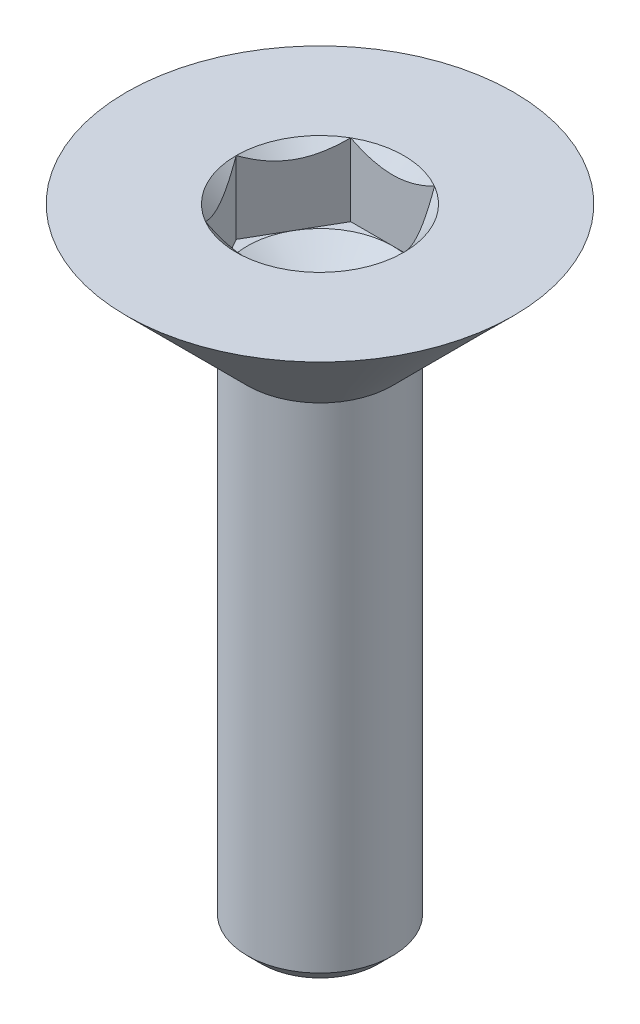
ISO-10303-21;
HEADER;
FILE_DESCRIPTION(('STEP AP214'),'2;1');
FILE_NAME('part.step','',(''),(''),'','','');
FILE_SCHEMA(('AUTOMOTIVE_DESIGN { 1 0 10303 214 1 1 1 1 }'));
ENDSEC;
DATA;
#1=APPLICATION_CONTEXT('core data for automotive mechanical design processes');
#2=APPLICATION_PROTOCOL_DEFINITION('international standard','automotive_design',2000,#1);
#3=PRODUCT_CONTEXT('',#1,'mechanical');
#4=PRODUCT('Part','Part','',(#3));
#5=PRODUCT_RELATED_PRODUCT_CATEGORY('part','',(#4));
#6=PRODUCT_DEFINITION_FORMATION('','',#4);
#7=PRODUCT_DEFINITION_CONTEXT('part definition',#1,'design');
#8=PRODUCT_DEFINITION('design','',#6,#7);
#9=PRODUCT_DEFINITION_SHAPE('','',#8);
#10=(LENGTH_UNIT() NAMED_UNIT(*) SI_UNIT(.MILLI.,.METRE.));
#11=(NAMED_UNIT(*) PLANE_ANGLE_UNIT() SI_UNIT($,.RADIAN.));
#12=(NAMED_UNIT(*) SI_UNIT($,.STERADIAN.) SOLID_ANGLE_UNIT());
#13=UNCERTAINTY_MEASURE_WITH_UNIT(LENGTH_MEASURE(1.E-05),#10,'distance_accuracy_value','');
#14=(GEOMETRIC_REPRESENTATION_CONTEXT(3) GLOBAL_UNCERTAINTY_ASSIGNED_CONTEXT((#13)) GLOBAL_UNIT_ASSIGNED_CONTEXT((#10,
#11,#12)) REPRESENTATION_CONTEXT('',''));
#15=CARTESIAN_POINT('',(0.,0.,0.));
#16=DIRECTION('',(0.,0.,1.));
#17=DIRECTION('',(1.,0.,0.));
#18=AXIS2_PLACEMENT_3D('',#15,#16,#17);
#19=CARTESIAN_POINT('',(3.46410161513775,2.,0.));
#20=DIRECTION('',(0.,1.,0.));
#21=DIRECTION('',(0.,0.,1.));
#22=AXIS2_PLACEMENT_3D('',#19,#20,#21);
#23=PLANE('',#22);
#24=CARTESIAN_POINT('',(0.,2.,0.));
#25=DIRECTION('',(0.,1.,0.));
#26=DIRECTION('',(0.,0.,1.));
#27=AXIS2_PLACEMENT_3D('',#24,#25,#26);
#28=CIRCLE('',#27,3.);
#29=CARTESIAN_POINT('',(0.,2.,3.));
#30=VERTEX_POINT('',#29);
#31=CARTESIAN_POINT('',(2.59807621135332,2.,1.5));
#32=VERTEX_POINT('',#31);
#33=EDGE_CURVE('E96',#30,#32,#28,.T.);
#34=ORIENTED_EDGE('',*,*,#33,.F.);
#35=DIRECTION('',(1.,0.,0.));
#36=VECTOR('',#35,1.);
#37=CARTESIAN_POINT('',(-1.73205080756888,2.,3.));
#38=LINE('',#37,#36);
#39=CARTESIAN_POINT('',(1.73205080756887,2.,3.));
#40=VERTEX_POINT('',#39);
#41=EDGE_CURVE('E40',#30,#40,#38,.T.);
#42=ORIENTED_EDGE('',*,*,#41,.T.);
#43=DIRECTION('',(0.5,0.,-0.866025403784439));
#44=VECTOR('',#43,1.);
#45=CARTESIAN_POINT('',(1.73205080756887,2.,3.));
#46=LINE('',#45,#44);
#47=EDGE_CURVE('E117',#40,#32,#46,.T.);
#48=ORIENTED_EDGE('',*,*,#47,.T.);
#49=EDGE_LOOP('',(#34,#42,#48));
#50=FACE_BOUND('',#49,.T.);
#51=ADVANCED_FACE('F17',(#50),#23,.T.);
#52=CARTESIAN_POINT('',(0.,2.,0.));
#53=DIRECTION('',(0.,1.,0.));
#54=DIRECTION('',(0.,0.,1.));
#55=AXIS2_PLACEMENT_3D('',#52,#53,#54);
#56=CIRCLE('',#55,3.);
#57=CARTESIAN_POINT('',(2.59807621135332,2.,-1.5));
#58=VERTEX_POINT('',#57);
#59=EDGE_CURVE('E98',#32,#58,#56,.T.);
#60=ORIENTED_EDGE('',*,*,#59,.F.);
#61=CARTESIAN_POINT('',(3.46410161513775,2.,0.));
#62=VERTEX_POINT('',#61);
#63=EDGE_CURVE('E107',#32,#62,#46,.T.);
#64=ORIENTED_EDGE('',*,*,#63,.T.);
#65=DIRECTION('',(-0.5,0.,-0.866025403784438));
#66=VECTOR('',#65,1.);
#67=CARTESIAN_POINT('',(3.46410161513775,2.,0.));
#68=LINE('',#67,#66);
#69=EDGE_CURVE('E110',#62,#58,#68,.T.);
#70=ORIENTED_EDGE('',*,*,#69,.T.);
#71=EDGE_LOOP('',(#60,#64,#70));
#72=FACE_BOUND('',#71,.T.);
#73=ADVANCED_FACE('F106',(#72),#23,.T.);
#74=CARTESIAN_POINT('',(0.,2.,-3.));
#75=VERTEX_POINT('',#74);
#76=EDGE_CURVE('E111',#58,#75,#56,.T.);
#77=ORIENTED_EDGE('',*,*,#76,.F.);
#78=CARTESIAN_POINT('',(1.73205080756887,2.,-3.));
#79=VERTEX_POINT('',#78);
#80=EDGE_CURVE('E123',#58,#79,#68,.T.);
#81=ORIENTED_EDGE('',*,*,#80,.T.);
#82=DIRECTION('',(-1.,0.,0.));
#83=VECTOR('',#82,1.);
#84=CARTESIAN_POINT('',(1.73205080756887,2.,-3.));
#85=LINE('',#84,#83);
#86=EDGE_CURVE('E129',#79,#75,#85,.T.);
#87=ORIENTED_EDGE('',*,*,#86,.T.);
#88=EDGE_LOOP('',(#77,#81,#87));
#89=FACE_BOUND('',#88,.T.);
#90=ADVANCED_FACE('F182',(#89),#23,.T.);
#91=CARTESIAN_POINT('',(-2.59807621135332,2.,-1.5));
#92=VERTEX_POINT('',#91);
#93=EDGE_CURVE('E212',#75,#92,#56,.T.);
#94=ORIENTED_EDGE('',*,*,#93,.F.);
#95=CARTESIAN_POINT('',(-1.73205080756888,2.,-3.));
#96=VERTEX_POINT('',#95);
#97=EDGE_CURVE('E128',#75,#96,#85,.T.);
#98=ORIENTED_EDGE('',*,*,#97,.T.);
#99=DIRECTION('',(-0.5,0.,0.866025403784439));
#100=VECTOR('',#99,1.);
#101=CARTESIAN_POINT('',(-1.73205080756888,2.,-3.));
#102=LINE('',#101,#100);
#103=EDGE_CURVE('E133',#96,#92,#102,.T.);
#104=ORIENTED_EDGE('',*,*,#103,.T.);
#105=EDGE_LOOP('',(#94,#98,#104));
#106=FACE_BOUND('',#105,.T.);
#107=ADVANCED_FACE('F200',(#106),#23,.T.);
#108=CARTESIAN_POINT('',(-2.59807621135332,2.,1.5));
#109=VERTEX_POINT('',#108);
#110=EDGE_CURVE('E32',#92,#109,#56,.T.);
#111=ORIENTED_EDGE('',*,*,#110,.F.);
#112=CARTESIAN_POINT('',(-3.46410161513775,2.,0.));
#113=VERTEX_POINT('',#112);
#114=EDGE_CURVE('E132',#92,#113,#102,.T.);
#115=ORIENTED_EDGE('',*,*,#114,.T.);
#116=DIRECTION('',(0.5,0.,0.866025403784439));
#117=VECTOR('',#116,1.);
#118=CARTESIAN_POINT('',(-3.46410161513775,2.,0.));
#119=LINE('',#118,#117);
#120=EDGE_CURVE('E137',#113,#109,#119,.T.);
#121=ORIENTED_EDGE('',*,*,#120,.T.);
#122=EDGE_LOOP('',(#111,#115,#121));
#123=FACE_BOUND('',#122,.T.);
#124=ADVANCED_FACE('F189',(#123),#23,.T.);
#125=CARTESIAN_POINT('',(0.,0.,0.));
#126=DIRECTION('',(0.,1.,0.));
#127=DIRECTION('',(0.,0.,1.));
#128=AXIS2_PLACEMENT_3D('',#125,#126,#127);
#129=CONICAL_SURFACE('',#128,3.,0.78539816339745);
#130=CARTESIAN_POINT('',(0.,5.,0.));
#131=DIRECTION('',(0.,1.,0.));
#132=DIRECTION('',(0.,0.,1.));
#133=AXIS2_PLACEMENT_3D('',#130,#131,#132);
#134=CIRCLE('',#133,8.);
#135=CARTESIAN_POINT('',(0.,5.,8.));
#136=VERTEX_POINT('',#135);
#137=EDGE_CURVE('E161',#136,#136,#134,.T.);
#138=ORIENTED_EDGE('',*,*,#137,.F.);
#139=EDGE_LOOP('',(#138));
#140=FACE_BOUND('',#139,.T.);
#141=CARTESIAN_POINT('',(0.,0.,0.));
#142=DIRECTION('',(0.,1.,0.));
#143=DIRECTION('',(0.,0.,1.));
#144=AXIS2_PLACEMENT_3D('',#141,#142,#143);
#145=CIRCLE('',#144,3.);
#146=CARTESIAN_POINT('',(0.,0.,3.));
#147=VERTEX_POINT('',#146);
#148=EDGE_CURVE('E145',#147,#147,#145,.T.);
#149=ORIENTED_EDGE('',*,*,#148,.T.);
#150=EDGE_LOOP('',(#149));
#151=FACE_BOUND('',#150,.T.);
#152=ADVANCED_FACE('F19',(#140,#151),#129,.T.);
#153=CARTESIAN_POINT('',(0.,5.,0.));
#154=DIRECTION('',(0.,1.,0.));
#155=DIRECTION('',(0.,0.,1.));
#156=AXIS2_PLACEMENT_3D('',#153,#154,#155);
#157=PLANE('',#156);
#158=CARTESIAN_POINT('',(0.,5.,0.));
#159=DIRECTION('',(0.,1.,0.));
#160=DIRECTION('',(0.,0.,1.));
#161=AXIS2_PLACEMENT_3D('',#158,#159,#160);
#162=CIRCLE('',#161,3.46410161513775);
#163=CARTESIAN_POINT('',(1.73205080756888,5.,3.));
#164=VERTEX_POINT('',#163);
#165=CARTESIAN_POINT('',(3.46410161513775,5.,0.));
#166=VERTEX_POINT('',#165);
#167=EDGE_CURVE('E101',#164,#166,#162,.T.);
#168=ORIENTED_EDGE('',*,*,#167,.F.);
#169=CARTESIAN_POINT('',(0.,5.,0.));
#170=DIRECTION('',(0.,1.,0.));
#171=DIRECTION('',(0.,0.,1.));
#172=AXIS2_PLACEMENT_3D('',#169,#170,#171);
#173=CIRCLE('',#172,3.46410161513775);
#174=CARTESIAN_POINT('',(-1.73205080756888,5.,3.));
#175=VERTEX_POINT('',#174);
#176=EDGE_CURVE('E121',#175,#164,#173,.T.);
#177=ORIENTED_EDGE('',*,*,#176,.F.);
#178=CARTESIAN_POINT('',(0.,5.,0.));
#179=DIRECTION('',(0.,1.,0.));
#180=DIRECTION('',(0.,0.,1.));
#181=AXIS2_PLACEMENT_3D('',#178,#179,#180);
#182=CIRCLE('',#181,3.46410161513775);
#183=CARTESIAN_POINT('',(-3.46410161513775,5.,0.));
#184=VERTEX_POINT('',#183);
#185=EDGE_CURVE('E237',#184,#175,#182,.T.);
#186=ORIENTED_EDGE('',*,*,#185,.F.);
#187=CARTESIAN_POINT('',(0.,5.,0.));
#188=DIRECTION('',(0.,1.,0.));
#189=DIRECTION('',(0.,0.,1.));
#190=AXIS2_PLACEMENT_3D('',#187,#188,#189);
#191=CIRCLE('',#190,3.46410161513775);
#192=CARTESIAN_POINT('',(-1.73205080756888,5.,-3.));
#193=VERTEX_POINT('',#192);
#194=EDGE_CURVE('E230',#193,#184,#191,.T.);
#195=ORIENTED_EDGE('',*,*,#194,.F.);
#196=CARTESIAN_POINT('',(0.,5.,0.));
#197=DIRECTION('',(0.,1.,0.));
#198=DIRECTION('',(0.,0.,1.));
#199=AXIS2_PLACEMENT_3D('',#196,#197,#198);
#200=CIRCLE('',#199,3.46410161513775);
#201=CARTESIAN_POINT('',(1.73205080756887,5.,-3.));
#202=VERTEX_POINT('',#201);
#203=EDGE_CURVE('E231',#202,#193,#200,.T.);
#204=ORIENTED_EDGE('',*,*,#203,.F.);
#205=CARTESIAN_POINT('',(0.,5.,0.));
#206=DIRECTION('',(0.,1.,0.));
#207=DIRECTION('',(0.,0.,1.));
#208=AXIS2_PLACEMENT_3D('',#205,#206,#207);
#209=CIRCLE('',#208,3.46410161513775);
#210=EDGE_CURVE('E265',#166,#202,#209,.T.);
#211=ORIENTED_EDGE('',*,*,#210,.F.);
#212=EDGE_LOOP('',(#168,#177,#186,#195,#204,#211));
#213=FACE_BOUND('',#212,.T.);
#214=ORIENTED_EDGE('',*,*,#137,.T.);
#215=EDGE_LOOP('',(#214));
#216=FACE_BOUND('',#215,.T.);
#217=ADVANCED_FACE('F205',(#213,#216),#157,.T.);
#218=CARTESIAN_POINT('',(0.,-21.,0.));
#219=DIRECTION('',(0.,1.,0.));
#220=DIRECTION('',(0.,0.,1.));
#221=AXIS2_PLACEMENT_3D('',#218,#219,#220);
#222=CYLINDRICAL_SURFACE('',#221,3.);
#223=CARTESIAN_POINT('',(0.,-20.4,0.));
#224=DIRECTION('',(0.,1.,0.));
#225=DIRECTION('',(0.,0.,1.));
#226=AXIS2_PLACEMENT_3D('',#223,#224,#225);
#227=CIRCLE('',#226,3.);
#228=CARTESIAN_POINT('',(0.,-20.4,3.));
#229=VERTEX_POINT('',#228);
#230=EDGE_CURVE('E25',#229,#229,#227,.T.);
#231=ORIENTED_EDGE('',*,*,#230,.T.);
#232=EDGE_LOOP('',(#231));
#233=FACE_BOUND('',#232,.T.);
#234=ORIENTED_EDGE('',*,*,#148,.F.);
#235=EDGE_LOOP('',(#234));
#236=FACE_BOUND('',#235,.T.);
#237=ADVANCED_FACE('F166',(#233,#236),#222,.T.);
#238=CARTESIAN_POINT('',(0.,-21.,0.));
#239=DIRECTION('',(0.,1.,0.));
#240=DIRECTION('',(0.,0.,1.));
#241=AXIS2_PLACEMENT_3D('',#238,#239,#240);
#242=PLANE('',#241);
#243=CARTESIAN_POINT('',(0.,-21.,0.));
#244=DIRECTION('',(0.,1.,0.));
#245=DIRECTION('',(0.,0.,1.));
#246=AXIS2_PLACEMENT_3D('',#243,#244,#245);
#247=CIRCLE('',#246,2.4);
#248=CARTESIAN_POINT('',(0.,-21.,2.4));
#249=VERTEX_POINT('',#248);
#250=EDGE_CURVE('E11',#249,#249,#247,.F.);
#251=ORIENTED_EDGE('',*,*,#250,.T.);
#252=EDGE_LOOP('',(#251));
#253=FACE_BOUND('',#252,.T.);
#254=ADVANCED_FACE('F341',(#253),#242,.F.);
#255=CARTESIAN_POINT('',(1.73205080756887,2.,3.));
#256=DIRECTION('',(0.866025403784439,0.,0.5));
#257=DIRECTION('',(0.5,0.,-0.866025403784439));
#258=AXIS2_PLACEMENT_3D('',#255,#256,#257);
#259=PLANE('',#258);
#260=DIRECTION('',(0.,1.,0.));
#261=VECTOR('',#260,1.);
#262=CARTESIAN_POINT('',(1.73205080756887,2.,3.));
#263=LINE('',#262,#261);
#264=EDGE_CURVE('E143',#40,#164,#263,.T.);
#265=ORIENTED_EDGE('',*,*,#264,.T.);
#266=CARTESIAN_POINT('',(3.4642170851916,5.00011547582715,-0.000200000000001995));
#267=CARTESIAN_POINT('',(3.40467869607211,4.94062831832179,0.102923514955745));
#268=CARTESIAN_POINT('',(3.3441447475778,4.88463497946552,0.207771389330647));
#269=CARTESIAN_POINT('',(3.22070940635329,4.78211259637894,0.421567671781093));
#270=CARTESIAN_POINT('',(3.15779627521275,4.73564059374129,0.530536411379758));
#271=CARTESIAN_POINT('',(3.03093496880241,4.6560331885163,0.750266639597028));
#272=CARTESIAN_POINT('',(2.96701910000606,4.62269770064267,0.860972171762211));
#273=CARTESIAN_POINT('',(2.83778025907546,4.5713375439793,1.08482041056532));
#274=CARTESIAN_POINT('',(2.77246123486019,4.5532745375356,1.19795627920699));
#275=CARTESIAN_POINT('',(2.65988677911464,4.53697690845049,1.3929409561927));
#276=CARTESIAN_POINT('',(2.6127767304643,4.5345643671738,1.47453795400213));
#277=CARTESIAN_POINT('',(2.51863325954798,4.53862943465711,1.63759922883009));
#278=CARTESIAN_POINT('',(2.47159986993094,4.5451101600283,1.71906344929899));
#279=CARTESIAN_POINT('',(2.37797867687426,4.56659172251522,1.88122011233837));
#280=CARTESIAN_POINT('',(2.33139143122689,4.58160208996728,1.9619115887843));
#281=CARTESIAN_POINT('',(2.23901705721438,4.61932364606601,2.12190869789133));
#282=CARTESIAN_POINT('',(2.19322986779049,4.64203424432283,2.2012144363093));
#283=CARTESIAN_POINT('',(2.11194373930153,4.68876068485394,2.34200614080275));
#284=CARTESIAN_POINT('',(2.07626488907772,4.7115483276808,2.40380372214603));
#285=CARTESIAN_POINT('',(2.00554773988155,4.76079628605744,2.52628941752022));
#286=CARTESIAN_POINT('',(1.97050946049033,4.78725671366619,2.5869774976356));
#287=CARTESIAN_POINT('',(1.90118383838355,4.84325699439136,2.70705299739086));
#288=CARTESIAN_POINT('',(1.86689452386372,4.87278716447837,2.76644383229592));
#289=CARTESIAN_POINT('',(1.79895094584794,4.93453909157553,2.88412556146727));
#290=CARTESIAN_POINT('',(1.76529630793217,4.96675919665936,2.94241710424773));
#291=CARTESIAN_POINT('',(1.73193533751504,5.00011547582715,3.0002));
#292=B_SPLINE_CURVE_WITH_KNOTS('',3,(#266,#267,#268,#269,#270,#271,#272,#273,#274,#275,#276,
#277,#278,#279,#280,#281,#282,#283,#284,#285,#286,#287,#288,#289,#290,#291),.UNSPECIFIED.,.F.,
.F.,(4,2,2,2,2,2,2,2,2,2,2,2,4),(0.,0.399603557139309,0.80153528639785,1.19708369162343,
1.59163620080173,1.87398941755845,2.15644160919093,2.43921001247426,2.72195674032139,
2.94657516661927,3.17120044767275,3.3951375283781,3.61893808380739),.UNSPECIFIED.);
#293=EDGE_CURVE('E256',#166,#164,#292,.T.);
#294=ORIENTED_EDGE('',*,*,#293,.F.);
#295=DIRECTION('',(0.,1.,0.));
#296=VECTOR('',#295,1.);
#297=CARTESIAN_POINT('',(3.46410161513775,2.,0.));
#298=LINE('',#297,#296);
#299=EDGE_CURVE('E120',#62,#166,#298,.T.);
#300=ORIENTED_EDGE('',*,*,#299,.F.);
#301=ORIENTED_EDGE('',*,*,#63,.F.);
#302=ORIENTED_EDGE('',*,*,#47,.F.);
#303=EDGE_LOOP('',(#265,#294,#300,#301,#302));
#304=FACE_BOUND('',#303,.T.);
#305=ADVANCED_FACE('F116',(#304),#259,.F.);
#306=CARTESIAN_POINT('',(-1.73205080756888,2.,3.));
#307=DIRECTION('',(0.,0.,1.));
#308=DIRECTION('',(1.,0.,0.));
#309=AXIS2_PLACEMENT_3D('',#306,#307,#308);
#310=PLANE('',#309);
#311=DIRECTION('',(0.,1.,0.));
#312=VECTOR('',#311,1.);
#313=CARTESIAN_POINT('',(-1.73205080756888,2.,3.));
#314=LINE('',#313,#312);
#315=CARTESIAN_POINT('',(-1.73205080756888,2.,3.));
#316=VERTEX_POINT('',#315);
#317=EDGE_CURVE('E146',#316,#175,#314,.T.);
#318=ORIENTED_EDGE('',*,*,#317,.T.);
#319=CARTESIAN_POINT('',(-3.50026189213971,6.14586945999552,3.));
#320=CARTESIAN_POINT('',(-3.41523785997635,6.08132698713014,3.));
#321=CARTESIAN_POINT('',(-3.32974294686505,6.01739482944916,3.));
#322=CARTESIAN_POINT('',(-3.1576236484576,5.89102603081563,3.));
#323=CARTESIAN_POINT('',(-3.07099898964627,5.82858976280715,3.));
#324=CARTESIAN_POINT('',(-2.89579876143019,5.70504340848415,3.));
#325=CARTESIAN_POINT('',(-2.80721328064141,5.64394733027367,3.));
#326=CARTESIAN_POINT('',(-2.62854680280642,5.52398973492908,3.));
#327=CARTESIAN_POINT('',(-2.53846591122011,5.4651280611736,3.));
#328=CARTESIAN_POINT('',(-2.35119236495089,5.34674237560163,3.));
#329=CARTESIAN_POINT('',(-2.25389399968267,5.28738473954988,3.));
#330=CARTESIAN_POINT('',(-2.05704987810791,5.17252661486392,3.));
#331=CARTESIAN_POINT('',(-1.95750441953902,5.11702561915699,3.));
#332=CARTESIAN_POINT('',(-1.7561226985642,5.01104681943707,3.));
#333=CARTESIAN_POINT('',(-1.654293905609,4.96055493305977,3.));
#334=CARTESIAN_POINT('',(-1.4478291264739,4.8657342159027,3.));
#335=CARTESIAN_POINT('',(-1.34319445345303,4.82140256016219,3.));
#336=CARTESIAN_POINT('',(-1.14005723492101,4.7439653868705,3.));
#337=CARTESIAN_POINT('',(-1.04180014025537,4.71022262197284,3.));
#338=CARTESIAN_POINT('',(-0.842880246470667,4.65061383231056,3.));
#339=CARTESIAN_POINT('',(-0.742217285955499,4.62474833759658,3.));
#340=CARTESIAN_POINT('',(-0.540783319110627,4.58268913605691,3.));
#341=CARTESIAN_POINT('',(-0.440048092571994,4.56632688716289,3.));
#342=CARTESIAN_POINT('',(-0.23745012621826,4.54359904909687,3.));
#343=CARTESIAN_POINT('',(-0.135587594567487,4.53723164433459,3.));
#344=CARTESIAN_POINT('',(0.0643530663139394,4.53498673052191,3.));
#345=CARTESIAN_POINT('',(0.162426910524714,4.53871728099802,3.));
#346=CARTESIAN_POINT('',(0.357756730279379,4.5555865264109,3.));
#347=CARTESIAN_POINT('',(0.455012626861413,4.56872611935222,3.));
#348=CARTESIAN_POINT('',(0.64964782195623,4.60391252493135,3.));
#349=CARTESIAN_POINT('',(0.746998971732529,4.62611253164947,3.));
#350=CARTESIAN_POINT('',(0.939574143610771,4.67822215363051,3.));
#351=CARTESIAN_POINT('',(1.03479832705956,4.70813118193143,3.));
#352=CARTESIAN_POINT('',(1.23072205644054,4.77713022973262,3.));
#353=CARTESIAN_POINT('',(1.33122436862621,4.81677445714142,3.));
#354=CARTESIAN_POINT('',(1.52961364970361,4.9021565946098,3.));
#355=CARTESIAN_POINT('',(1.627499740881,4.94789651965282,3.));
#356=CARTESIAN_POINT('',(1.82115087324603,5.04439091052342,3.));
#357=CARTESIAN_POINT('',(1.91690786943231,5.09516139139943,3.));
#358=CARTESIAN_POINT('',(2.10621926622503,5.2005921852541,3.));
#359=CARTESIAN_POINT('',(2.19977405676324,5.2552518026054,3.));
#360=CARTESIAN_POINT('',(2.38037956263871,5.36490860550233,3.));
#361=CARTESIAN_POINT('',(2.46752265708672,5.4197544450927,3.));
#362=CARTESIAN_POINT('',(2.64031239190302,5.53176179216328,3.));
#363=CARTESIAN_POINT('',(2.72595891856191,5.58892347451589,3.));
#364=CARTESIAN_POINT('',(2.89525866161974,5.70467887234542,3.));
#365=CARTESIAN_POINT('',(2.97892240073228,5.76325725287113,3.));
#366=CARTESIAN_POINT('',(3.14510504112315,5.8819701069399,3.));
#367=CARTESIAN_POINT('',(3.22762425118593,5.94210414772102,3.));
#368=CARTESIAN_POINT('',(3.30966391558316,6.0028744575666,3.));
#369=B_SPLINE_CURVE_WITH_KNOTS('',3,(#319,#320,#321,#322,#323,#324,#325,#326,#327,#328,#329,
#330,#331,#332,#333,#334,#335,#336,#337,#338,#339,#340,#341,#342,#343,#344,#345,#346,#347,#348,
#349,#350,#351,#352,#353,#354,#355,#356,#357,#358,#359,#360,#361,#362,#363,#364,#365,#366,#367,
#368),.UNSPECIFIED.,.F.,.F.,(4,2,2,2,2,2,2,2,2,2,2,2,2,2,2,2,2,2,2,2,2,2,2,2,4),(0.,
0.320245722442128,0.640570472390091,0.963374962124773,1.28615678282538,1.62801128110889,
1.96982074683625,2.31064028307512,2.65130300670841,2.96269931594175,3.27411657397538,
3.57982738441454,3.88548265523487,4.17944606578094,4.473437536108,4.77262056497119,
5.07178082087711,5.39564608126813,5.71961866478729,6.04465796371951,6.36963927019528,
6.67849410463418,6.98737230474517,7.29375054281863,7.60004444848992),.UNSPECIFIED.);
#370=EDGE_CURVE('E248',#164,#175,#369,.F.);
#371=ORIENTED_EDGE('',*,*,#370,.F.);
#372=ORIENTED_EDGE('',*,*,#264,.F.);
#373=ORIENTED_EDGE('',*,*,#41,.F.);
#374=EDGE_CURVE('E140',#316,#30,#38,.T.);
#375=ORIENTED_EDGE('',*,*,#374,.F.);
#376=EDGE_LOOP('',(#318,#371,#372,#373,#375));
#377=FACE_BOUND('',#376,.T.);
#378=ADVANCED_FACE('F254',(#377),#310,.F.);
#379=CARTESIAN_POINT('',(-3.46410161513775,2.,0.));
#380=DIRECTION('',(-0.866025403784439,0.,0.5));
#381=DIRECTION('',(0.5,0.,0.866025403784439));
#382=AXIS2_PLACEMENT_3D('',#379,#380,#381);
#383=PLANE('',#382);
#384=DIRECTION('',(0.,1.,0.));
#385=VECTOR('',#384,1.);
#386=CARTESIAN_POINT('',(-3.46410161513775,2.,0.));
#387=LINE('',#386,#385);
#388=EDGE_CURVE('E149',#113,#184,#387,.T.);
#389=ORIENTED_EDGE('',*,*,#388,.T.);
#390=CARTESIAN_POINT('',(-1.73193533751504,5.00011547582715,3.0002));
#391=CARTESIAN_POINT('',(-1.79147372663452,4.94062831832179,2.89707648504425));
#392=CARTESIAN_POINT('',(-1.85200767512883,4.88463497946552,2.79222861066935));
#393=CARTESIAN_POINT('',(-1.97544301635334,4.78211259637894,2.5784323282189));
#394=CARTESIAN_POINT('',(-2.03835614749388,4.73564059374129,2.46946358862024));
#395=CARTESIAN_POINT('',(-2.16521745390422,4.6560331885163,2.24973336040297));
#396=CARTESIAN_POINT('',(-2.22913332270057,4.62269770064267,2.13902782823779));
#397=CARTESIAN_POINT('',(-2.35837216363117,4.5713375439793,1.91517958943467));
#398=CARTESIAN_POINT('',(-2.42369118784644,4.5532745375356,1.80204372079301));
#399=CARTESIAN_POINT('',(-2.53626564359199,4.53697690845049,1.6070590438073));
#400=CARTESIAN_POINT('',(-2.58337569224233,4.53456436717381,1.52546204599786));
#401=CARTESIAN_POINT('',(-2.67751916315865,4.53862943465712,1.36240077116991));
#402=CARTESIAN_POINT('',(-2.7245525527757,4.54511016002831,1.28093655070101));
#403=CARTESIAN_POINT('',(-2.81817374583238,4.56659172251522,1.11877988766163));
#404=CARTESIAN_POINT('',(-2.86476099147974,4.58160208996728,1.03808841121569));
#405=CARTESIAN_POINT('',(-2.95713536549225,4.61932364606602,0.878091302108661));
#406=CARTESIAN_POINT('',(-3.00292255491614,4.64203424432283,0.798785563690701));
#407=CARTESIAN_POINT('',(-3.08420868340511,4.68876068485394,0.657993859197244));
#408=CARTESIAN_POINT('',(-3.11988753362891,4.7115483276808,0.596196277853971));
#409=CARTESIAN_POINT('',(-3.19060468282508,4.76079628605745,0.473710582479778));
#410=CARTESIAN_POINT('',(-3.2256429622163,4.7872567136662,0.413022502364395));
#411=CARTESIAN_POINT('',(-3.29496858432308,4.84325699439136,0.292947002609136));
#412=CARTESIAN_POINT('',(-3.32925789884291,4.87278716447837,0.233556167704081));
#413=CARTESIAN_POINT('',(-3.39720147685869,4.93453909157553,0.115874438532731));
#414=CARTESIAN_POINT('',(-3.43085611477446,4.96675919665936,0.0575828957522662));
#415=CARTESIAN_POINT('',(-3.46421708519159,5.00011547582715,-0.00019999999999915));
#416=B_SPLINE_CURVE_WITH_KNOTS('',3,(#390,#391,#392,#393,#394,#395,#396,#397,#398,#399,#400,
#401,#402,#403,#404,#405,#406,#407,#408,#409,#410,#411,#412,#413,#414,#415),.UNSPECIFIED.,.F.,
.F.,(4,2,2,2,2,2,2,2,2,2,2,2,4),(0.,0.399603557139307,0.801535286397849,1.19708369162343,
1.59163620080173,1.87398941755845,2.15644160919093,2.43921001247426,2.72195674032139,
2.94657516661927,3.17120044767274,3.3951375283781,3.61893808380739),.UNSPECIFIED.);
#417=EDGE_CURVE('E235',#175,#184,#416,.T.);
#418=ORIENTED_EDGE('',*,*,#417,.F.);
#419=ORIENTED_EDGE('',*,*,#317,.F.);
#420=EDGE_CURVE('E136',#109,#316,#119,.T.);
#421=ORIENTED_EDGE('',*,*,#420,.F.);
#422=ORIENTED_EDGE('',*,*,#120,.F.);
#423=EDGE_LOOP('',(#389,#418,#419,#421,#422));
#424=FACE_BOUND('',#423,.T.);
#425=ADVANCED_FACE('F250',(#424),#383,.F.);
#426=CARTESIAN_POINT('',(-1.73205080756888,2.,-3.));
#427=DIRECTION('',(-0.866025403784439,0.,-0.5));
#428=DIRECTION('',(-0.5,0.,0.866025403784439));
#429=AXIS2_PLACEMENT_3D('',#426,#427,#428);
#430=PLANE('',#429);
#431=DIRECTION('',(0.,1.,0.));
#432=VECTOR('',#431,1.);
#433=CARTESIAN_POINT('',(-1.73205080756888,2.,-3.));
#434=LINE('',#433,#432);
#435=EDGE_CURVE('E152',#96,#193,#434,.T.);
#436=ORIENTED_EDGE('',*,*,#435,.T.);
#437=CARTESIAN_POINT('',(-3.4642170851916,5.00011547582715,0.00020000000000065));
#438=CARTESIAN_POINT('',(-3.40467869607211,4.94062831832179,-0.102923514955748));
#439=CARTESIAN_POINT('',(-3.3441447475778,4.88463497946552,-0.20777138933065));
#440=CARTESIAN_POINT('',(-3.2207094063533,4.78211259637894,-0.421567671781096));
#441=CARTESIAN_POINT('',(-3.15779627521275,4.73564059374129,-0.53053641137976));
#442=CARTESIAN_POINT('',(-3.03093496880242,4.6560331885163,-0.750266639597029));
#443=CARTESIAN_POINT('',(-2.96701910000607,4.62269770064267,-0.860972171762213));
#444=CARTESIAN_POINT('',(-2.83778025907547,4.57133754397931,-1.08482041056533));
#445=CARTESIAN_POINT('',(-2.77246123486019,4.55327453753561,-1.19795627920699));
#446=CARTESIAN_POINT('',(-2.65988677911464,4.5369769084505,-1.3929409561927));
#447=CARTESIAN_POINT('',(-2.6127767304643,4.53456436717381,-1.47453795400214));
#448=CARTESIAN_POINT('',(-2.51863325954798,4.53862943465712,-1.63759922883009));
#449=CARTESIAN_POINT('',(-2.47159986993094,4.54511016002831,-1.71906344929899));
#450=CARTESIAN_POINT('',(-2.37797867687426,4.56659172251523,-1.88122011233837));
#451=CARTESIAN_POINT('',(-2.33139143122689,4.58160208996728,-1.96191158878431));
#452=CARTESIAN_POINT('',(-2.23901705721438,4.61932364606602,-2.12190869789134));
#453=CARTESIAN_POINT('',(-2.19322986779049,4.64203424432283,-2.2012144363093));
#454=CARTESIAN_POINT('',(-2.11194373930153,4.68876068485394,-2.34200614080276));
#455=CARTESIAN_POINT('',(-2.07626488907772,4.7115483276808,-2.40380372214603));
#456=CARTESIAN_POINT('',(-2.00554773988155,4.76079628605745,-2.52628941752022));
#457=CARTESIAN_POINT('',(-1.97050946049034,4.7872567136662,-2.58697749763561));
#458=CARTESIAN_POINT('',(-1.90118383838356,4.84325699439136,-2.70705299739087));
#459=CARTESIAN_POINT('',(-1.86689452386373,4.87278716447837,-2.76644383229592));
#460=CARTESIAN_POINT('',(-1.79895094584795,4.93453909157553,-2.88412556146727));
#461=CARTESIAN_POINT('',(-1.76529630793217,4.96675919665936,-2.94241710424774));
#462=CARTESIAN_POINT('',(-1.73193533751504,5.00011547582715,-3.0002));
#463=B_SPLINE_CURVE_WITH_KNOTS('',3,(#437,#438,#439,#440,#441,#442,#443,#444,#445,#446,#447,
#448,#449,#450,#451,#452,#453,#454,#455,#456,#457,#458,#459,#460,#461,#462),.UNSPECIFIED.,.F.,
.F.,(4,2,2,2,2,2,2,2,2,2,2,2,4),(0.,0.399603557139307,0.801535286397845,1.19708369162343,
1.59163620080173,1.87398941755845,2.15644160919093,2.43921001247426,2.72195674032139,
2.94657516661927,3.17120044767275,3.3951375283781,3.61893808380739),.UNSPECIFIED.);
#464=EDGE_CURVE('E226',#184,#193,#463,.T.);
#465=ORIENTED_EDGE('',*,*,#464,.F.);
#466=ORIENTED_EDGE('',*,*,#388,.F.);
#467=ORIENTED_EDGE('',*,*,#114,.F.);
#468=ORIENTED_EDGE('',*,*,#103,.F.);
#469=EDGE_LOOP('',(#436,#465,#466,#467,#468));
#470=FACE_BOUND('',#469,.T.);
#471=ADVANCED_FACE('F215',(#470),#430,.F.);
#472=CARTESIAN_POINT('',(1.73205080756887,2.,-3.));
#473=DIRECTION('',(0.,0.,-1.));
#474=DIRECTION('',(-1.,0.,0.));
#475=AXIS2_PLACEMENT_3D('',#472,#473,#474);
#476=PLANE('',#475);
#477=DIRECTION('',(0.,1.,0.));
#478=VECTOR('',#477,1.);
#479=CARTESIAN_POINT('',(1.73205080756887,2.,-3.));
#480=LINE('',#479,#478);
#481=EDGE_CURVE('E155',#79,#202,#480,.T.);
#482=ORIENTED_EDGE('',*,*,#481,.T.);
#483=CARTESIAN_POINT('',(-3.50026189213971,6.14586945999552,-3.));
#484=CARTESIAN_POINT('',(-3.41523785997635,6.08132698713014,-3.));
#485=CARTESIAN_POINT('',(-3.32974294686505,6.01739482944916,-3.));
#486=CARTESIAN_POINT('',(-3.1576236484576,5.89102603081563,-3.));
#487=CARTESIAN_POINT('',(-3.07099898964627,5.82858976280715,-3.));
#488=CARTESIAN_POINT('',(-2.89579876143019,5.70504340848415,-3.));
#489=CARTESIAN_POINT('',(-2.80721328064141,5.64394733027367,-3.));
#490=CARTESIAN_POINT('',(-2.62854680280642,5.52398973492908,-3.));
#491=CARTESIAN_POINT('',(-2.53846591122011,5.4651280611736,-3.));
#492=CARTESIAN_POINT('',(-2.35119236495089,5.34674237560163,-3.));
#493=CARTESIAN_POINT('',(-2.25389399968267,5.28738473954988,-3.));
#494=CARTESIAN_POINT('',(-2.05704987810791,5.17252661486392,-3.));
#495=CARTESIAN_POINT('',(-1.95750441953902,5.11702561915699,-3.));
#496=CARTESIAN_POINT('',(-1.7561226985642,5.01104681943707,-3.));
#497=CARTESIAN_POINT('',(-1.654293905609,4.96055493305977,-3.));
#498=CARTESIAN_POINT('',(-1.4478291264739,4.8657342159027,-3.));
#499=CARTESIAN_POINT('',(-1.34319445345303,4.82140256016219,-3.));
#500=CARTESIAN_POINT('',(-1.14005723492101,4.7439653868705,-3.));
#501=CARTESIAN_POINT('',(-1.04180014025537,4.71022262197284,-3.));
#502=CARTESIAN_POINT('',(-0.842880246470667,4.65061383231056,-3.));
#503=CARTESIAN_POINT('',(-0.742217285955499,4.62474833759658,-3.));
#504=CARTESIAN_POINT('',(-0.540783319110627,4.58268913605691,-3.));
#505=CARTESIAN_POINT('',(-0.440048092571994,4.56632688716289,-3.));
#506=CARTESIAN_POINT('',(-0.237450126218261,4.54359904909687,-3.));
#507=CARTESIAN_POINT('',(-0.135587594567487,4.53723164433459,-3.));
#508=CARTESIAN_POINT('',(0.0643530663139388,4.53498673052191,-3.));
#509=CARTESIAN_POINT('',(0.162426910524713,4.53871728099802,-3.));
#510=CARTESIAN_POINT('',(0.357756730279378,4.5555865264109,-3.));
#511=CARTESIAN_POINT('',(0.455012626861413,4.56872611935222,-3.));
#512=CARTESIAN_POINT('',(0.64964782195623,4.60391252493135,-3.));
#513=CARTESIAN_POINT('',(0.746998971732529,4.62611253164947,-3.));
#514=CARTESIAN_POINT('',(0.93957414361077,4.67822215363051,-3.));
#515=CARTESIAN_POINT('',(1.03479832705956,4.70813118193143,-3.));
#516=CARTESIAN_POINT('',(1.23072205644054,4.77713022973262,-3.));
#517=CARTESIAN_POINT('',(1.33122436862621,4.81677445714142,-3.));
#518=CARTESIAN_POINT('',(1.52961364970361,4.9021565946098,-3.));
#519=CARTESIAN_POINT('',(1.627499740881,4.94789651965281,-3.));
#520=CARTESIAN_POINT('',(1.82115087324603,5.04439091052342,-3.));
#521=CARTESIAN_POINT('',(1.91690786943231,5.09516139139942,-3.));
#522=CARTESIAN_POINT('',(2.10621926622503,5.2005921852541,-3.));
#523=CARTESIAN_POINT('',(2.19977405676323,5.2552518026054,-3.));
#524=CARTESIAN_POINT('',(2.38037956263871,5.36490860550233,-3.));
#525=CARTESIAN_POINT('',(2.46752265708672,5.4197544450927,-3.));
#526=CARTESIAN_POINT('',(2.64031239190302,5.53176179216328,-3.));
#527=CARTESIAN_POINT('',(2.72595891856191,5.58892347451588,-3.));
#528=CARTESIAN_POINT('',(2.89525866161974,5.70467887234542,-3.));
#529=CARTESIAN_POINT('',(2.97892240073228,5.76325725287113,-3.));
#530=CARTESIAN_POINT('',(3.14510504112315,5.8819701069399,-3.));
#531=CARTESIAN_POINT('',(3.22762425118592,5.94210414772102,-3.));
#532=CARTESIAN_POINT('',(3.30966391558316,6.0028744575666,-3.));
#533=B_SPLINE_CURVE_WITH_KNOTS('',3,(#483,#484,#485,#486,#487,#488,#489,#490,#491,#492,#493,
#494,#495,#496,#497,#498,#499,#500,#501,#502,#503,#504,#505,#506,#507,#508,#509,#510,#511,#512,
#513,#514,#515,#516,#517,#518,#519,#520,#521,#522,#523,#524,#525,#526,#527,#528,#529,#530,#531,
#532),.UNSPECIFIED.,.F.,.F.,(4,2,2,2,2,2,2,2,2,2,2,2,2,2,2,2,2,2,2,2,2,2,2,2,4),(0.,
0.32024572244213,0.640570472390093,0.963374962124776,1.28615678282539,1.62801128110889,
1.96982074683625,2.31064028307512,2.65130300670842,2.96269931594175,3.27411657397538,
3.57982738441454,3.88548265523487,4.17944606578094,4.473437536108,4.7726205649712,
5.07178082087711,5.39564608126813,5.71961866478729,6.04465796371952,6.36963927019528,
6.67849410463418,6.98737230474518,7.29375054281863,7.60004444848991),.UNSPECIFIED.);
#534=EDGE_CURVE('E224',#193,#202,#533,.T.);
#535=ORIENTED_EDGE('',*,*,#534,.F.);
#536=ORIENTED_EDGE('',*,*,#435,.F.);
#537=ORIENTED_EDGE('',*,*,#97,.F.);
#538=ORIENTED_EDGE('',*,*,#86,.F.);
#539=EDGE_LOOP('',(#482,#535,#536,#537,#538));
#540=FACE_BOUND('',#539,.T.);
#541=ADVANCED_FACE('F196',(#540),#476,.F.);
#542=CARTESIAN_POINT('',(3.46410161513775,2.,0.));
#543=DIRECTION('',(0.866025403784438,0.,-0.5));
#544=DIRECTION('',(-0.5,0.,-0.866025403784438));
#545=AXIS2_PLACEMENT_3D('',#542,#543,#544);
#546=PLANE('',#545);
#547=ORIENTED_EDGE('',*,*,#299,.T.);
#548=CARTESIAN_POINT('',(1.73193533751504,5.00011547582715,-3.0002));
#549=CARTESIAN_POINT('',(1.79147372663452,4.94062831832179,-2.89707648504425));
#550=CARTESIAN_POINT('',(1.85200767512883,4.88463497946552,-2.79222861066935));
#551=CARTESIAN_POINT('',(1.97544301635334,4.78211259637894,-2.57843232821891));
#552=CARTESIAN_POINT('',(2.03835614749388,4.73564059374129,-2.46946358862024));
#553=CARTESIAN_POINT('',(2.16521745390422,4.6560331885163,-2.24973336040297));
#554=CARTESIAN_POINT('',(2.22913332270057,4.62269770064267,-2.13902782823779));
#555=CARTESIAN_POINT('',(2.35837216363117,4.57133754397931,-1.91517958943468));
#556=CARTESIAN_POINT('',(2.42369118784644,4.55327453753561,-1.80204372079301));
#557=CARTESIAN_POINT('',(2.53626564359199,4.5369769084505,-1.6070590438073));
#558=CARTESIAN_POINT('',(2.58337569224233,4.53456436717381,-1.52546204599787));
#559=CARTESIAN_POINT('',(2.67751916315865,4.53862943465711,-1.36240077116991));
#560=CARTESIAN_POINT('',(2.7245525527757,4.54511016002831,-1.28093655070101));
#561=CARTESIAN_POINT('',(2.81817374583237,4.56659172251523,-1.11877988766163));
#562=CARTESIAN_POINT('',(2.86476099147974,4.58160208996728,-1.0380884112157));
#563=CARTESIAN_POINT('',(2.95713536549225,4.61932364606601,-0.878091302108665));
#564=CARTESIAN_POINT('',(3.00292255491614,4.64203424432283,-0.798785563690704));
#565=CARTESIAN_POINT('',(3.0842086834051,4.68876068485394,-0.657993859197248));
#566=CARTESIAN_POINT('',(3.11988753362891,4.7115483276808,-0.596196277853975));
#567=CARTESIAN_POINT('',(3.19060468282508,4.76079628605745,-0.473710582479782));
#568=CARTESIAN_POINT('',(3.2256429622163,4.7872567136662,-0.413022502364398));
#569=CARTESIAN_POINT('',(3.29496858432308,4.84325699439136,-0.292947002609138));
#570=CARTESIAN_POINT('',(3.32925789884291,4.87278716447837,-0.233556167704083));
#571=CARTESIAN_POINT('',(3.39720147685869,4.93453909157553,-0.115874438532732));
#572=CARTESIAN_POINT('',(3.43085611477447,4.96675919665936,-0.0575828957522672));
#573=CARTESIAN_POINT('',(3.4642170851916,5.00011547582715,0.000199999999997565));
#574=B_SPLINE_CURVE_WITH_KNOTS('',3,(#548,#549,#550,#551,#552,#553,#554,#555,#556,#557,#558,
#559,#560,#561,#562,#563,#564,#565,#566,#567,#568,#569,#570,#571,#572,#573),.UNSPECIFIED.,.F.,
.F.,(4,2,2,2,2,2,2,2,2,2,2,2,4),(0.,0.399603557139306,0.801535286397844,1.19708369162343,
1.59163620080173,1.87398941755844,2.15644160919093,2.43921001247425,2.72195674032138,
2.94657516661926,3.17120044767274,3.3951375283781,3.61893808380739),.UNSPECIFIED.);
#575=EDGE_CURVE('E259',#202,#166,#574,.T.);
#576=ORIENTED_EDGE('',*,*,#575,.F.);
#577=ORIENTED_EDGE('',*,*,#481,.F.);
#578=ORIENTED_EDGE('',*,*,#80,.F.);
#579=ORIENTED_EDGE('',*,*,#69,.F.);
#580=EDGE_LOOP('',(#547,#576,#577,#578,#579));
#581=FACE_BOUND('',#580,.T.);
#582=ADVANCED_FACE('F187',(#581),#546,.F.);
#583=EDGE_CURVE('E100',#109,#30,#56,.T.);
#584=ORIENTED_EDGE('',*,*,#583,.F.);
#585=ORIENTED_EDGE('',*,*,#420,.T.);
#586=ORIENTED_EDGE('',*,*,#374,.T.);
#587=EDGE_LOOP('',(#584,#585,#586));
#588=FACE_BOUND('',#587,.T.);
#589=ADVANCED_FACE('F178',(#588),#23,.T.);
#590=CARTESIAN_POINT('',(0.,5.,0.));
#591=DIRECTION('',(0.,1.,0.));
#592=DIRECTION('',(0.,0.,1.));
#593=AXIS2_PLACEMENT_3D('',#590,#591,#592);
#594=CONICAL_SURFACE('',#593,3.46410161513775,0.78539816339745);
#595=ORIENTED_EDGE('',*,*,#370,.T.);
#596=ORIENTED_EDGE('',*,*,#176,.T.);
#597=EDGE_LOOP('',(#595,#596));
#598=FACE_BOUND('',#597,.T.);
#599=ADVANCED_FACE('F186',(#598),#594,.F.);
#600=CARTESIAN_POINT('',(0.,5.,0.));
#601=DIRECTION('',(0.,1.,0.));
#602=DIRECTION('',(0.,0.,1.));
#603=AXIS2_PLACEMENT_3D('',#600,#601,#602);
#604=CONICAL_SURFACE('',#603,3.46410161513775,0.78539816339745);
#605=ORIENTED_EDGE('',*,*,#417,.T.);
#606=ORIENTED_EDGE('',*,*,#185,.T.);
#607=EDGE_LOOP('',(#605,#606));
#608=FACE_BOUND('',#607,.T.);
#609=ADVANCED_FACE('F193',(#608),#604,.F.);
#610=CARTESIAN_POINT('',(0.,5.,0.));
#611=DIRECTION('',(0.,1.,0.));
#612=DIRECTION('',(0.,0.,1.));
#613=AXIS2_PLACEMENT_3D('',#610,#611,#612);
#614=CONICAL_SURFACE('',#613,3.46410161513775,0.78539816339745);
#615=ORIENTED_EDGE('',*,*,#464,.T.);
#616=ORIENTED_EDGE('',*,*,#194,.T.);
#617=EDGE_LOOP('',(#615,#616));
#618=FACE_BOUND('',#617,.T.);
#619=ADVANCED_FACE('F298',(#618),#614,.F.);
#620=CARTESIAN_POINT('',(0.,5.,0.));
#621=DIRECTION('',(0.,1.,0.));
#622=DIRECTION('',(0.,0.,1.));
#623=AXIS2_PLACEMENT_3D('',#620,#621,#622);
#624=CONICAL_SURFACE('',#623,3.46410161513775,0.78539816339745);
#625=ORIENTED_EDGE('',*,*,#534,.T.);
#626=ORIENTED_EDGE('',*,*,#203,.T.);
#627=EDGE_LOOP('',(#625,#626));
#628=FACE_BOUND('',#627,.T.);
#629=ADVANCED_FACE('F291',(#628),#624,.F.);
#630=CARTESIAN_POINT('',(0.,5.,0.));
#631=DIRECTION('',(0.,1.,0.));
#632=DIRECTION('',(0.,0.,1.));
#633=AXIS2_PLACEMENT_3D('',#630,#631,#632);
#634=CONICAL_SURFACE('',#633,3.46410161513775,0.78539816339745);
#635=ORIENTED_EDGE('',*,*,#575,.T.);
#636=ORIENTED_EDGE('',*,*,#210,.T.);
#637=EDGE_LOOP('',(#635,#636));
#638=FACE_BOUND('',#637,.T.);
#639=ADVANCED_FACE('F264',(#638),#634,.F.);
#640=CARTESIAN_POINT('',(0.,5.,0.));
#641=DIRECTION('',(0.,1.,0.));
#642=DIRECTION('',(0.,0.,1.));
#643=AXIS2_PLACEMENT_3D('',#640,#641,#642);
#644=CONICAL_SURFACE('',#643,3.46410161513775,0.78539816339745);
#645=ORIENTED_EDGE('',*,*,#293,.T.);
#646=ORIENTED_EDGE('',*,*,#167,.T.);
#647=EDGE_LOOP('',(#645,#646));
#648=FACE_BOUND('',#647,.T.);
#649=ADVANCED_FACE('F94',(#648),#644,.F.);
#650=CARTESIAN_POINT('',(0.,2.,0.));
#651=DIRECTION('',(0.,1.,0.));
#652=DIRECTION('',(0.,0.,1.));
#653=AXIS2_PLACEMENT_3D('',#650,#651,#652);
#654=CONICAL_SURFACE('',#653,3.,1.0471975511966);
#655=CARTESIAN_POINT('',(0.,0.267949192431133,0.));
#656=VERTEX_POINT('',#655);
#657=VERTEX_LOOP('',#656);
#658=FACE_BOUND('',#657,.T.);
#659=ORIENTED_EDGE('',*,*,#33,.T.);
#660=ORIENTED_EDGE('',*,*,#59,.T.);
#661=ORIENTED_EDGE('',*,*,#76,.T.);
#662=ORIENTED_EDGE('',*,*,#93,.T.);
#663=ORIENTED_EDGE('',*,*,#110,.T.);
#664=ORIENTED_EDGE('',*,*,#583,.T.);
#665=EDGE_LOOP('',(#659,#660,#661,#662,#663,#664));
#666=FACE_BOUND('',#665,.T.);
#667=ADVANCED_FACE('F91',(#658,#666),#654,.F.);
#668=CARTESIAN_POINT('',(0.,-20.4,0.));
#669=DIRECTION('',(0.,1.,0.));
#670=DIRECTION('',(0.,0.,1.));
#671=AXIS2_PLACEMENT_3D('',#668,#669,#670);
#672=CONICAL_SURFACE('',#671,3.,0.785398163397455);
#673=ORIENTED_EDGE('',*,*,#250,.F.);
#674=EDGE_LOOP('',(#673));
#675=FACE_BOUND('',#674,.T.);
#676=ORIENTED_EDGE('',*,*,#230,.F.);
#677=EDGE_LOOP('',(#676));
#678=FACE_BOUND('',#677,.T.);
#679=ADVANCED_FACE('F93',(#675,#678),#672,.T.);
#680=CLOSED_SHELL('',(#51,#73,#90,#107,#124,#152,#217,#237,#254,#305,#378,#425,#471,#541,#582,
#589,#599,#609,#619,#629,#639,#649,#667,#679));
#681=MANIFOLD_SOLID_BREP('B1',#680);
#682=ADVANCED_BREP_SHAPE_REPRESENTATION('',(#18,#681),#14);
#683=SHAPE_DEFINITION_REPRESENTATION(#9,#682);
ENDSEC;
END-ISO-10303-21;
